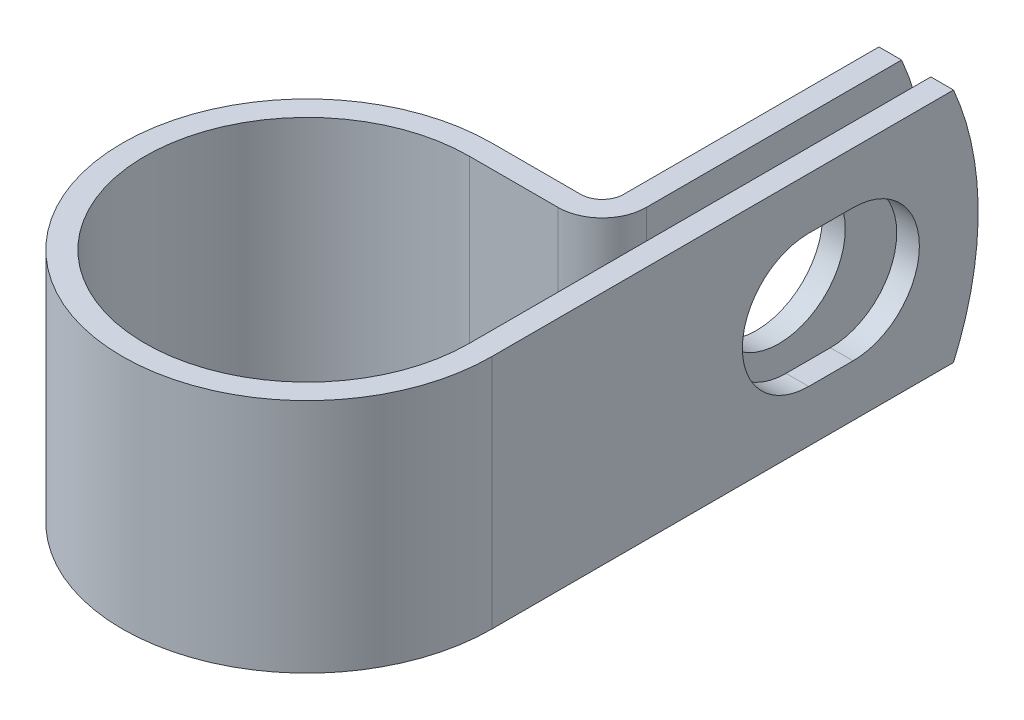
from build123d import *

# Parameters (mm, degrees)
EXTRUDE_THIN1_DEPTH = 6.35
SKETCH2_R           = 3.5687
CUT_EXTRUDE1_DEPTH  = 1.2192
CUT_EXTRUDE2_REACH  = 35.471
CUT_EXTRUDE3_DEPTH  = 32.253613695


with BuildPart() as part:
    # Sketch1 → Extrude-Thin1 (new, symmetric)
    with BuildSketch(Plane(origin=(0, 0, 0), x_dir=(1, 0, 0), z_dir=(0, 1, 0))):
        with BuildLine():
            Line((8.7249, 26.162), (8.7249, 8.7249))
            Line((8.7249, 8.7249), (8.7249, 0))
            ThreePointArc((8.7249, 0), (-6.169435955, -6.169435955), (0, 8.7249))
            Line((0, 8.7249), (4.77266, 8.7249))
            ThreePointArc((4.77266, 8.7249), (6.453763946, 9.421236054), (7.1501, 11.10234))
            Line((7.1501, 11.10234), (7.1501, 26.162))
            Line((7.1501, 26.162), (5.9309, 26.162))
            Line((5.9309, 26.162), (5.9309, 11.10234))
            ThreePointArc((5.9309, 11.10234), (5.591659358, 10.283340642), (4.77266, 9.9441))
            Line((4.77266, 9.9441), (0, 9.9441))
            ThreePointArc((0, 9.9441), (-7.031540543, -7.031540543), (9.9441, 0))
            Line((9.9441, 0), (9.9441, 8.7249))
            Line((9.9441, 8.7249), (9.9441, 26.162))
            Line((9.9441, 26.162), (8.7249, 26.162))
        make_face()
    extrude(amount=EXTRUDE_THIN1_DEPTH, both=True)

    # Sketch2 → Cut-Extrude1 (cut)
    with BuildSketch(Plane.ZY.offset(-5.9309)):
        with Locations((-18.2372, 0)):
            Circle(SKETCH2_R)
    extrude(amount=-CUT_EXTRUDE1_DEPTH, mode=Mode.SUBTRACT)

    # Sketch3 → Cut-Extrude2 (cut, up to next)
    with BuildSketch(Plane(origin=(9.9441, 0, 0), x_dir=(0, 0, -1), z_dir=(1, 0, 0)), mode=Mode.PRIVATE) as cut_extrude2_sk1:
        with BuildLine():
            Line((17.0434, 3.5687), (19.431, 3.5687))
            ThreePointArc((19.431, 3.5687), (22.9997, 0), (19.431, -3.5687))
            Line((19.431, -3.5687), (17.0434, -3.5687))
            ThreePointArc((17.0434, -3.5687), (13.4747, 0), (17.0434, 3.5687))
        make_face()
    cut_extrude2_tool1 = extrude(cut_extrude2_sk1.sketch, amount=-CUT_EXTRUDE2_REACH, mode=Mode.PRIVATE) & part.part
    add(cut_extrude2_tool1.solids().sort_by_distance((9.9441, 0, -18.2372))[0], mode=Mode.SUBTRACT)

    # Sketch4 → Cut-Extrude3 (cut, through all)
    with BuildSketch(Plane.ZY.offset(-5.9309)):
        with BuildLine():
            Line((-24.836677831, 6.35), (-26.162, 6.35))
            Line((-26.162, 6.35), (-26.162, 5.4e-08))
            ThreePointArc((-26.162, 5.4e-08), (-25.827137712, 3.24341562), (-24.836677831, 6.35))
        make_face()
        with BuildLine():
            ThreePointArc((-24.836677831, -6.35), (-25.827137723, -3.243415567), (-26.162, 5.4e-08))
            Line((-26.162, 5.4e-08), (-26.162, -6.35))
            Line((-26.162, -6.35), (-24.836677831, -6.35))
        make_face()
    extrude(amount=-CUT_EXTRUDE3_DEPTH, mode=Mode.SUBTRACT)


solid = part.part
